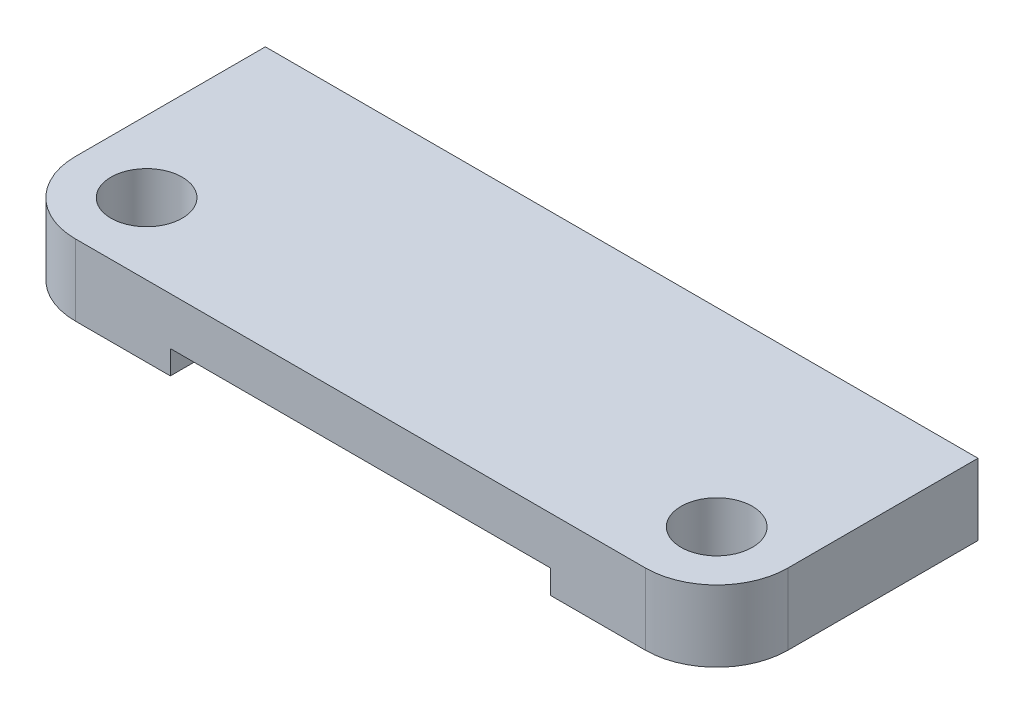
ISO-10303-21;
HEADER;
FILE_DESCRIPTION(('STEP AP214'),'2;1');
FILE_NAME('part.step','',(''),(''),'','','');
FILE_SCHEMA(('AUTOMOTIVE_DESIGN { 1 0 10303 214 1 1 1 1 }'));
ENDSEC;
DATA;
#1=APPLICATION_CONTEXT('core data for automotive mechanical design processes');
#2=APPLICATION_PROTOCOL_DEFINITION('international standard','automotive_design',2000,#1);
#3=PRODUCT_CONTEXT('',#1,'mechanical');
#4=PRODUCT('Part','Part','',(#3));
#5=PRODUCT_RELATED_PRODUCT_CATEGORY('part','',(#4));
#6=PRODUCT_DEFINITION_FORMATION('','',#4);
#7=PRODUCT_DEFINITION_CONTEXT('part definition',#1,'design');
#8=PRODUCT_DEFINITION('design','',#6,#7);
#9=PRODUCT_DEFINITION_SHAPE('','',#8);
#10=(LENGTH_UNIT() NAMED_UNIT(*) SI_UNIT(.MILLI.,.METRE.));
#11=(NAMED_UNIT(*) PLANE_ANGLE_UNIT() SI_UNIT($,.RADIAN.));
#12=(NAMED_UNIT(*) SI_UNIT($,.STERADIAN.) SOLID_ANGLE_UNIT());
#13=UNCERTAINTY_MEASURE_WITH_UNIT(LENGTH_MEASURE(1.E-05),#10,'distance_accuracy_value','');
#14=(GEOMETRIC_REPRESENTATION_CONTEXT(3) GLOBAL_UNCERTAINTY_ASSIGNED_CONTEXT((#13)) GLOBAL_UNIT_ASSIGNED_CONTEXT((#10,
#11,#12)) REPRESENTATION_CONTEXT('',''));
#15=CARTESIAN_POINT('',(0.,0.,0.));
#16=DIRECTION('',(0.,0.,1.));
#17=DIRECTION('',(1.,0.,0.));
#18=AXIS2_PLACEMENT_3D('',#15,#16,#17);
#19=CARTESIAN_POINT('',(-24.,0.,16.));
#20=DIRECTION('',(0.,1.,0.));
#21=DIRECTION('',(0.,0.,1.));
#22=AXIS2_PLACEMENT_3D('',#19,#20,#21);
#23=PLANE('',#22);
#24=CARTESIAN_POINT('',(-24.,0.,16.));
#25=DIRECTION('',(0.,1.,0.));
#26=DIRECTION('',(0.,0.,1.));
#27=AXIS2_PLACEMENT_3D('',#24,#25,#26);
#28=CIRCLE('',#27,3.);
#29=CARTESIAN_POINT('',(-24.,0.,19.));
#30=VERTEX_POINT('',#29);
#31=EDGE_CURVE('E178',#30,#30,#28,.T.);
#32=ORIENTED_EDGE('',*,*,#31,.T.);
#33=EDGE_LOOP('',(#32));
#34=FACE_BOUND('',#33,.T.);
#35=DIRECTION('',(-1.,0.,0.));
#36=VECTOR('',#35,1.);
#37=CARTESIAN_POINT('',(30.,0.,0.));
#38=LINE('',#37,#36);
#39=CARTESIAN_POINT('',(-16.,0.,0.));
#40=VERTEX_POINT('',#39);
#41=CARTESIAN_POINT('',(-30.,0.,0.));
#42=VERTEX_POINT('',#41);
#43=EDGE_CURVE('E82',#40,#42,#38,.T.);
#44=ORIENTED_EDGE('',*,*,#43,.F.);
#45=DIRECTION('',(0.,0.,1.));
#46=VECTOR('',#45,1.);
#47=CARTESIAN_POINT('',(-16.,0.,0.));
#48=LINE('',#47,#46);
#49=CARTESIAN_POINT('',(-16.,0.,22.));
#50=VERTEX_POINT('',#49);
#51=EDGE_CURVE('E159',#40,#50,#48,.T.);
#52=ORIENTED_EDGE('',*,*,#51,.T.);
#53=DIRECTION('',(1.,0.,0.));
#54=VECTOR('',#53,1.);
#55=CARTESIAN_POINT('',(-24.,0.,22.));
#56=LINE('',#55,#54);
#57=CARTESIAN_POINT('',(-24.,0.,22.));
#58=VERTEX_POINT('',#57);
#59=EDGE_CURVE('E137',#58,#50,#56,.T.);
#60=ORIENTED_EDGE('',*,*,#59,.F.);
#61=CARTESIAN_POINT('',(-24.,0.,16.));
#62=DIRECTION('',(0.,1.,0.));
#63=DIRECTION('',(0.,0.,1.));
#64=AXIS2_PLACEMENT_3D('',#61,#62,#63);
#65=CIRCLE('',#64,6.);
#66=CARTESIAN_POINT('',(-30.,0.,16.));
#67=VERTEX_POINT('',#66);
#68=EDGE_CURVE('E133',#67,#58,#65,.T.);
#69=ORIENTED_EDGE('',*,*,#68,.F.);
#70=DIRECTION('',(0.,0.,1.));
#71=VECTOR('',#70,1.);
#72=CARTESIAN_POINT('',(-30.,0.,0.));
#73=LINE('',#72,#71);
#74=EDGE_CURVE('E130',#42,#67,#73,.T.);
#75=ORIENTED_EDGE('',*,*,#74,.F.);
#76=EDGE_LOOP('',(#44,#52,#60,#69,#75));
#77=FACE_BOUND('',#76,.T.);
#78=ADVANCED_FACE('F31',(#34,#77),#23,.F.);
#79=CARTESIAN_POINT('',(-24.,6.,16.));
#80=DIRECTION('',(0.,1.,0.));
#81=DIRECTION('',(0.,0.,1.));
#82=AXIS2_PLACEMENT_3D('',#79,#80,#81);
#83=PLANE('',#82);
#84=CARTESIAN_POINT('',(-24.,6.,16.));
#85=DIRECTION('',(0.,1.,0.));
#86=DIRECTION('',(0.,0.,1.));
#87=AXIS2_PLACEMENT_3D('',#84,#85,#86);
#88=CIRCLE('',#87,3.);
#89=CARTESIAN_POINT('',(-24.,6.,19.));
#90=VERTEX_POINT('',#89);
#91=EDGE_CURVE('E134',#90,#90,#88,.T.);
#92=ORIENTED_EDGE('',*,*,#91,.F.);
#93=EDGE_LOOP('',(#92));
#94=FACE_BOUND('',#93,.T.);
#95=DIRECTION('',(0.,0.,1.));
#96=VECTOR('',#95,1.);
#97=CARTESIAN_POINT('',(-30.,6.,0.));
#98=LINE('',#97,#96);
#99=CARTESIAN_POINT('',(-30.,6.,0.));
#100=VERTEX_POINT('',#99);
#101=CARTESIAN_POINT('',(-30.,6.,16.));
#102=VERTEX_POINT('',#101);
#103=EDGE_CURVE('E146',#100,#102,#98,.T.);
#104=ORIENTED_EDGE('',*,*,#103,.T.);
#105=CARTESIAN_POINT('',(-24.,6.,16.));
#106=DIRECTION('',(0.,1.,0.));
#107=DIRECTION('',(0.,0.,1.));
#108=AXIS2_PLACEMENT_3D('',#105,#106,#107);
#109=CIRCLE('',#108,6.);
#110=CARTESIAN_POINT('',(-24.,6.,22.));
#111=VERTEX_POINT('',#110);
#112=EDGE_CURVE('E90',#102,#111,#109,.T.);
#113=ORIENTED_EDGE('',*,*,#112,.T.);
#114=DIRECTION('',(1.,0.,0.));
#115=VECTOR('',#114,1.);
#116=CARTESIAN_POINT('',(-24.,6.,22.));
#117=LINE('',#116,#115);
#118=CARTESIAN_POINT('',(24.,6.,22.));
#119=VERTEX_POINT('',#118);
#120=EDGE_CURVE('E108',#111,#119,#117,.T.);
#121=ORIENTED_EDGE('',*,*,#120,.T.);
#122=CARTESIAN_POINT('',(24.,6.,16.));
#123=DIRECTION('',(0.,1.,0.));
#124=DIRECTION('',(0.,0.,-1.));
#125=AXIS2_PLACEMENT_3D('',#122,#123,#124);
#126=CIRCLE('',#125,6.);
#127=CARTESIAN_POINT('',(30.,6.,16.));
#128=VERTEX_POINT('',#127);
#129=EDGE_CURVE('E100',#119,#128,#126,.T.);
#130=ORIENTED_EDGE('',*,*,#129,.T.);
#131=DIRECTION('',(0.,0.,-1.));
#132=VECTOR('',#131,1.);
#133=CARTESIAN_POINT('',(30.,6.,0.));
#134=LINE('',#133,#132);
#135=CARTESIAN_POINT('',(30.,6.,0.));
#136=VERTEX_POINT('',#135);
#137=EDGE_CURVE('E105',#128,#136,#134,.T.);
#138=ORIENTED_EDGE('',*,*,#137,.T.);
#139=DIRECTION('',(-1.,0.,0.));
#140=VECTOR('',#139,1.);
#141=CARTESIAN_POINT('',(30.,6.,0.));
#142=LINE('',#141,#140);
#143=EDGE_CURVE('E55',#136,#100,#142,.T.);
#144=ORIENTED_EDGE('',*,*,#143,.T.);
#145=EDGE_LOOP('',(#104,#113,#121,#130,#138,#144));
#146=FACE_BOUND('',#145,.T.);
#147=CARTESIAN_POINT('',(24.,6.,16.));
#148=DIRECTION('',(0.,1.,0.));
#149=DIRECTION('',(0.,0.,-1.));
#150=AXIS2_PLACEMENT_3D('',#147,#148,#149);
#151=CIRCLE('',#150,3.);
#152=CARTESIAN_POINT('',(24.,6.,13.));
#153=VERTEX_POINT('',#152);
#154=EDGE_CURVE('E175',#153,#153,#151,.T.);
#155=ORIENTED_EDGE('',*,*,#154,.F.);
#156=EDGE_LOOP('',(#155));
#157=FACE_BOUND('',#156,.T.);
#158=ADVANCED_FACE('F102',(#94,#146,#157),#83,.T.);
#159=CARTESIAN_POINT('',(16.,0.,22.));
#160=VERTEX_POINT('',#159);
#161=CARTESIAN_POINT('',(24.,0.,22.));
#162=VERTEX_POINT('',#161);
#163=EDGE_CURVE('E136',#160,#162,#56,.T.);
#164=ORIENTED_EDGE('',*,*,#163,.F.);
#165=DIRECTION('',(0.,0.,1.));
#166=VECTOR('',#165,1.);
#167=CARTESIAN_POINT('',(16.,0.,0.));
#168=LINE('',#167,#166);
#169=CARTESIAN_POINT('',(16.,0.,0.));
#170=VERTEX_POINT('',#169);
#171=EDGE_CURVE('E166',#170,#160,#168,.T.);
#172=ORIENTED_EDGE('',*,*,#171,.F.);
#173=CARTESIAN_POINT('',(30.,0.,0.));
#174=VERTEX_POINT('',#173);
#175=EDGE_CURVE('E143',#174,#170,#38,.T.);
#176=ORIENTED_EDGE('',*,*,#175,.F.);
#177=DIRECTION('',(0.,0.,-1.));
#178=VECTOR('',#177,1.);
#179=CARTESIAN_POINT('',(30.,0.,0.));
#180=LINE('',#179,#178);
#181=CARTESIAN_POINT('',(30.,0.,16.));
#182=VERTEX_POINT('',#181);
#183=EDGE_CURVE('E141',#182,#174,#180,.T.);
#184=ORIENTED_EDGE('',*,*,#183,.F.);
#185=CARTESIAN_POINT('',(24.,0.,16.));
#186=DIRECTION('',(0.,1.,0.));
#187=DIRECTION('',(0.,0.,-1.));
#188=AXIS2_PLACEMENT_3D('',#185,#186,#187);
#189=CIRCLE('',#188,6.);
#190=EDGE_CURVE('E117',#162,#182,#189,.T.);
#191=ORIENTED_EDGE('',*,*,#190,.F.);
#192=EDGE_LOOP('',(#164,#172,#176,#184,#191));
#193=FACE_BOUND('',#192,.T.);
#194=CARTESIAN_POINT('',(24.,0.,16.));
#195=DIRECTION('',(0.,1.,0.));
#196=DIRECTION('',(0.,0.,-1.));
#197=AXIS2_PLACEMENT_3D('',#194,#195,#196);
#198=CIRCLE('',#197,3.);
#199=CARTESIAN_POINT('',(24.,0.,13.));
#200=VERTEX_POINT('',#199);
#201=EDGE_CURVE('E179',#200,#200,#198,.T.);
#202=ORIENTED_EDGE('',*,*,#201,.T.);
#203=EDGE_LOOP('',(#202));
#204=FACE_BOUND('',#203,.T.);
#205=ADVANCED_FACE('F198',(#193,#204),#23,.F.);
#206=CARTESIAN_POINT('',(-30.,6.,0.));
#207=DIRECTION('',(1.,0.,0.));
#208=DIRECTION('',(0.,0.,-1.));
#209=AXIS2_PLACEMENT_3D('',#206,#207,#208);
#210=PLANE('',#209);
#211=ORIENTED_EDGE('',*,*,#74,.T.);
#212=DIRECTION('',(0.,-1.,0.));
#213=VECTOR('',#212,1.);
#214=CARTESIAN_POINT('',(-30.,6.,16.));
#215=LINE('',#214,#213);
#216=EDGE_CURVE('E11',#102,#67,#215,.T.);
#217=ORIENTED_EDGE('',*,*,#216,.F.);
#218=ORIENTED_EDGE('',*,*,#103,.F.);
#219=DIRECTION('',(0.,-1.,0.));
#220=VECTOR('',#219,1.);
#221=CARTESIAN_POINT('',(-30.,6.,0.));
#222=LINE('',#221,#220);
#223=EDGE_CURVE('E126',#100,#42,#222,.T.);
#224=ORIENTED_EDGE('',*,*,#223,.T.);
#225=EDGE_LOOP('',(#211,#217,#218,#224));
#226=FACE_BOUND('',#225,.T.);
#227=ADVANCED_FACE('F33',(#226),#210,.F.);
#228=CARTESIAN_POINT('',(-24.,6.,16.));
#229=DIRECTION('',(0.,-1.,0.));
#230=DIRECTION('',(0.,0.,-1.));
#231=AXIS2_PLACEMENT_3D('',#228,#229,#230);
#232=CYLINDRICAL_SURFACE('',#231,6.);
#233=ORIENTED_EDGE('',*,*,#68,.T.);
#234=DIRECTION('',(0.,-1.,0.));
#235=VECTOR('',#234,1.);
#236=CARTESIAN_POINT('',(-24.,6.,22.));
#237=LINE('',#236,#235);
#238=EDGE_CURVE('E39',#111,#58,#237,.T.);
#239=ORIENTED_EDGE('',*,*,#238,.F.);
#240=ORIENTED_EDGE('',*,*,#112,.F.);
#241=ORIENTED_EDGE('',*,*,#216,.T.);
#242=EDGE_LOOP('',(#233,#239,#240,#241));
#243=FACE_BOUND('',#242,.T.);
#244=ADVANCED_FACE('F191',(#243),#232,.T.);
#245=CARTESIAN_POINT('',(-24.,6.,22.));
#246=DIRECTION('',(0.,0.,-1.));
#247=DIRECTION('',(-1.,0.,0.));
#248=AXIS2_PLACEMENT_3D('',#245,#246,#247);
#249=PLANE('',#248);
#250=ORIENTED_EDGE('',*,*,#59,.T.);
#251=DIRECTION('',(0.,-1.,0.));
#252=VECTOR('',#251,1.);
#253=CARTESIAN_POINT('',(-16.,0.,22.));
#254=LINE('',#253,#252);
#255=CARTESIAN_POINT('',(-16.,2.,22.));
#256=VERTEX_POINT('',#255);
#257=EDGE_CURVE('E250',#256,#50,#254,.T.);
#258=ORIENTED_EDGE('',*,*,#257,.F.);
#259=DIRECTION('',(-1.,0.,0.));
#260=VECTOR('',#259,1.);
#261=CARTESIAN_POINT('',(-16.,2.,22.));
#262=LINE('',#261,#260);
#263=CARTESIAN_POINT('',(16.,2.,22.));
#264=VERTEX_POINT('',#263);
#265=EDGE_CURVE('E242',#264,#256,#262,.T.);
#266=ORIENTED_EDGE('',*,*,#265,.F.);
#267=DIRECTION('',(0.,1.,0.));
#268=VECTOR('',#267,1.);
#269=CARTESIAN_POINT('',(16.,0.,22.));
#270=LINE('',#269,#268);
#271=EDGE_CURVE('E248',#160,#264,#270,.T.);
#272=ORIENTED_EDGE('',*,*,#271,.F.);
#273=ORIENTED_EDGE('',*,*,#163,.T.);
#274=DIRECTION('',(0.,-1.,0.));
#275=VECTOR('',#274,1.);
#276=CARTESIAN_POINT('',(24.,6.,22.));
#277=LINE('',#276,#275);
#278=EDGE_CURVE('E120',#119,#162,#277,.T.);
#279=ORIENTED_EDGE('',*,*,#278,.F.);
#280=ORIENTED_EDGE('',*,*,#120,.F.);
#281=ORIENTED_EDGE('',*,*,#238,.T.);
#282=EDGE_LOOP('',(#250,#258,#266,#272,#273,#279,#280,#281));
#283=FACE_BOUND('',#282,.T.);
#284=ADVANCED_FACE('F152',(#283),#249,.F.);
#285=CARTESIAN_POINT('',(24.,6.,16.));
#286=DIRECTION('',(0.,-1.,0.));
#287=DIRECTION('',(0.,0.,-1.));
#288=AXIS2_PLACEMENT_3D('',#285,#286,#287);
#289=CYLINDRICAL_SURFACE('',#288,6.);
#290=ORIENTED_EDGE('',*,*,#190,.T.);
#291=DIRECTION('',(0.,-1.,0.));
#292=VECTOR('',#291,1.);
#293=CARTESIAN_POINT('',(30.,6.,16.));
#294=LINE('',#293,#292);
#295=EDGE_CURVE('E114',#128,#182,#294,.T.);
#296=ORIENTED_EDGE('',*,*,#295,.F.);
#297=ORIENTED_EDGE('',*,*,#129,.F.);
#298=ORIENTED_EDGE('',*,*,#278,.T.);
#299=EDGE_LOOP('',(#290,#296,#297,#298));
#300=FACE_BOUND('',#299,.T.);
#301=ADVANCED_FACE('F115',(#300),#289,.T.);
#302=CARTESIAN_POINT('',(30.,6.,0.));
#303=DIRECTION('',(-1.,0.,0.));
#304=DIRECTION('',(0.,0.,1.));
#305=AXIS2_PLACEMENT_3D('',#302,#303,#304);
#306=PLANE('',#305);
#307=ORIENTED_EDGE('',*,*,#183,.T.);
#308=DIRECTION('',(0.,-1.,0.));
#309=VECTOR('',#308,1.);
#310=CARTESIAN_POINT('',(30.,6.,0.));
#311=LINE('',#310,#309);
#312=EDGE_CURVE('E121',#136,#174,#311,.T.);
#313=ORIENTED_EDGE('',*,*,#312,.F.);
#314=ORIENTED_EDGE('',*,*,#137,.F.);
#315=ORIENTED_EDGE('',*,*,#295,.T.);
#316=EDGE_LOOP('',(#307,#313,#314,#315));
#317=FACE_BOUND('',#316,.T.);
#318=ADVANCED_FACE('F123',(#317),#306,.F.);
#319=CARTESIAN_POINT('',(30.,6.,0.));
#320=DIRECTION('',(0.,0.,1.));
#321=DIRECTION('',(1.,0.,0.));
#322=AXIS2_PLACEMENT_3D('',#319,#320,#321);
#323=PLANE('',#322);
#324=DIRECTION('',(-1.,0.,0.));
#325=VECTOR('',#324,1.);
#326=CARTESIAN_POINT('',(-16.,2.,0.));
#327=LINE('',#326,#325);
#328=CARTESIAN_POINT('',(16.,2.,0.));
#329=VERTEX_POINT('',#328);
#330=CARTESIAN_POINT('',(-16.,2.,0.));
#331=VERTEX_POINT('',#330);
#332=EDGE_CURVE('E46',#329,#331,#327,.T.);
#333=ORIENTED_EDGE('',*,*,#332,.T.);
#334=DIRECTION('',(0.,-1.,0.));
#335=VECTOR('',#334,1.);
#336=CARTESIAN_POINT('',(-16.,0.,0.));
#337=LINE('',#336,#335);
#338=EDGE_CURVE('E247',#331,#40,#337,.T.);
#339=ORIENTED_EDGE('',*,*,#338,.T.);
#340=ORIENTED_EDGE('',*,*,#43,.T.);
#341=ORIENTED_EDGE('',*,*,#223,.F.);
#342=ORIENTED_EDGE('',*,*,#143,.F.);
#343=ORIENTED_EDGE('',*,*,#312,.T.);
#344=ORIENTED_EDGE('',*,*,#175,.T.);
#345=DIRECTION('',(0.,1.,0.));
#346=VECTOR('',#345,1.);
#347=CARTESIAN_POINT('',(16.,0.,0.));
#348=LINE('',#347,#346);
#349=EDGE_CURVE('E171',#170,#329,#348,.T.);
#350=ORIENTED_EDGE('',*,*,#349,.T.);
#351=EDGE_LOOP('',(#333,#339,#340,#341,#342,#343,#344,#350));
#352=FACE_BOUND('',#351,.T.);
#353=ADVANCED_FACE('F229',(#352),#323,.F.);
#354=CARTESIAN_POINT('',(-24.,6.,16.));
#355=DIRECTION('',(0.,-1.,0.));
#356=DIRECTION('',(0.,0.,-1.));
#357=AXIS2_PLACEMENT_3D('',#354,#355,#356);
#358=CYLINDRICAL_SURFACE('',#357,3.);
#359=ORIENTED_EDGE('',*,*,#91,.T.);
#360=EDGE_LOOP('',(#359));
#361=FACE_BOUND('',#360,.T.);
#362=ORIENTED_EDGE('',*,*,#31,.F.);
#363=EDGE_LOOP('',(#362));
#364=FACE_BOUND('',#363,.T.);
#365=ADVANCED_FACE('F220',(#361,#364),#358,.F.);
#366=CARTESIAN_POINT('',(24.,6.,16.));
#367=DIRECTION('',(0.,-1.,0.));
#368=DIRECTION('',(0.,0.,-1.));
#369=AXIS2_PLACEMENT_3D('',#366,#367,#368);
#370=CYLINDRICAL_SURFACE('',#369,3.);
#371=ORIENTED_EDGE('',*,*,#154,.T.);
#372=EDGE_LOOP('',(#371));
#373=FACE_BOUND('',#372,.T.);
#374=ORIENTED_EDGE('',*,*,#201,.F.);
#375=EDGE_LOOP('',(#374));
#376=FACE_BOUND('',#375,.T.);
#377=ADVANCED_FACE('F217',(#373,#376),#370,.F.);
#378=CARTESIAN_POINT('',(-16.,0.,0.));
#379=DIRECTION('',(-1.,0.,0.));
#380=DIRECTION('',(0.,0.,1.));
#381=AXIS2_PLACEMENT_3D('',#378,#379,#380);
#382=PLANE('',#381);
#383=ORIENTED_EDGE('',*,*,#257,.T.);
#384=ORIENTED_EDGE('',*,*,#51,.F.);
#385=ORIENTED_EDGE('',*,*,#338,.F.);
#386=DIRECTION('',(0.,0.,1.));
#387=VECTOR('',#386,1.);
#388=CARTESIAN_POINT('',(-16.,2.,0.));
#389=LINE('',#388,#387);
#390=EDGE_CURVE('E182',#331,#256,#389,.T.);
#391=ORIENTED_EDGE('',*,*,#390,.T.);
#392=EDGE_LOOP('',(#383,#384,#385,#391));
#393=FACE_BOUND('',#392,.T.);
#394=ADVANCED_FACE('F219',(#393),#382,.F.);
#395=CARTESIAN_POINT('',(-16.,2.,0.));
#396=DIRECTION('',(0.,1.,0.));
#397=DIRECTION('',(0.,0.,1.));
#398=AXIS2_PLACEMENT_3D('',#395,#396,#397);
#399=PLANE('',#398);
#400=ORIENTED_EDGE('',*,*,#265,.T.);
#401=ORIENTED_EDGE('',*,*,#390,.F.);
#402=ORIENTED_EDGE('',*,*,#332,.F.);
#403=DIRECTION('',(0.,0.,1.));
#404=VECTOR('',#403,1.);
#405=CARTESIAN_POINT('',(16.,2.,0.));
#406=LINE('',#405,#404);
#407=EDGE_CURVE('E169',#329,#264,#406,.T.);
#408=ORIENTED_EDGE('',*,*,#407,.T.);
#409=EDGE_LOOP('',(#400,#401,#402,#408));
#410=FACE_BOUND('',#409,.T.);
#411=ADVANCED_FACE('F227',(#410),#399,.F.);
#412=CARTESIAN_POINT('',(16.,0.,0.));
#413=DIRECTION('',(1.,0.,0.));
#414=DIRECTION('',(0.,0.,-1.));
#415=AXIS2_PLACEMENT_3D('',#412,#413,#414);
#416=PLANE('',#415);
#417=ORIENTED_EDGE('',*,*,#271,.T.);
#418=ORIENTED_EDGE('',*,*,#407,.F.);
#419=ORIENTED_EDGE('',*,*,#349,.F.);
#420=ORIENTED_EDGE('',*,*,#171,.T.);
#421=EDGE_LOOP('',(#417,#418,#419,#420));
#422=FACE_BOUND('',#421,.T.);
#423=ADVANCED_FACE('F233',(#422),#416,.F.);
#424=CLOSED_SHELL('',(#78,#158,#205,#227,#244,#284,#301,#318,#353,#365,#377,#394,#411,#423));
#425=MANIFOLD_SOLID_BREP('B2',#424);
#426=ADVANCED_BREP_SHAPE_REPRESENTATION('',(#18,#425),#14);
#427=SHAPE_DEFINITION_REPRESENTATION(#9,#426);
ENDSEC;
END-ISO-10303-21;
